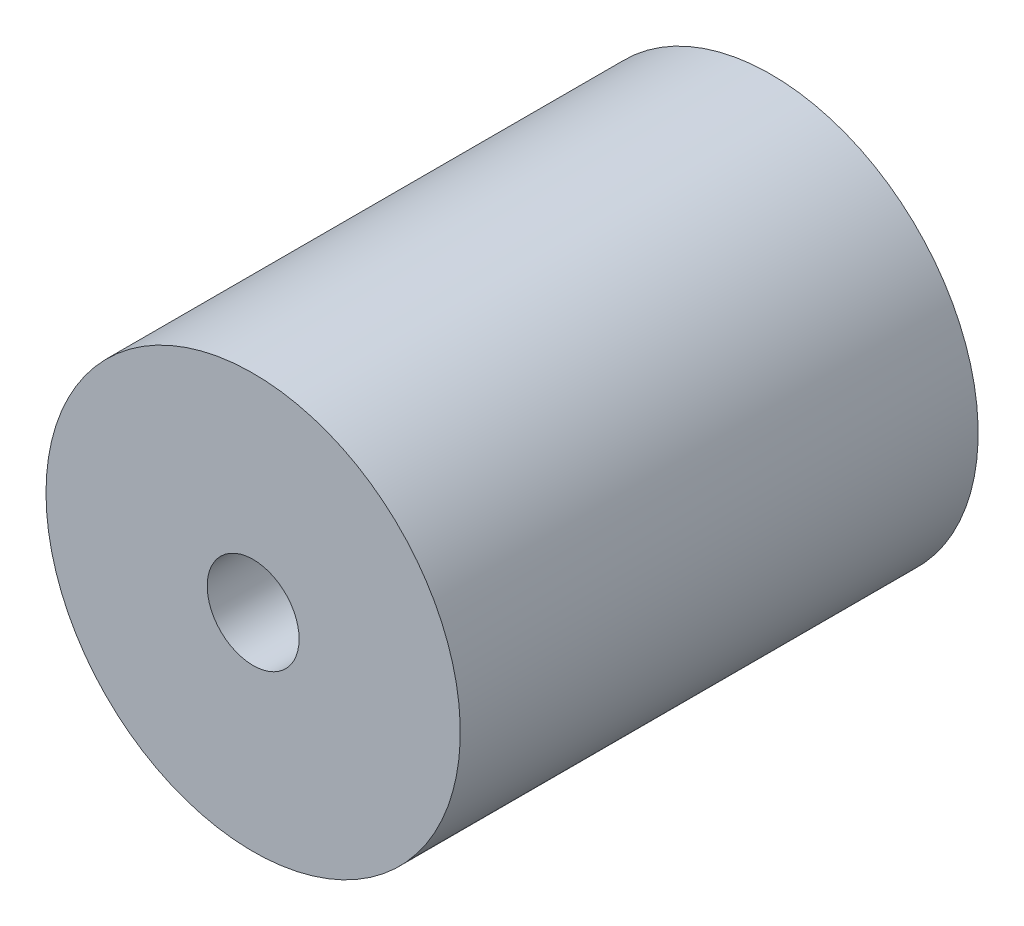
ISO-10303-21;
HEADER;
FILE_DESCRIPTION(('STEP AP214'),'2;1');
FILE_NAME('part.step','',(''),(''),'','','');
FILE_SCHEMA(('AUTOMOTIVE_DESIGN { 1 0 10303 214 1 1 1 1 }'));
ENDSEC;
DATA;
#1=APPLICATION_CONTEXT('core data for automotive mechanical design processes');
#2=APPLICATION_PROTOCOL_DEFINITION('international standard','automotive_design',2000,#1);
#3=PRODUCT_CONTEXT('',#1,'mechanical');
#4=PRODUCT('Part','Part','',(#3));
#5=PRODUCT_RELATED_PRODUCT_CATEGORY('part','',(#4));
#6=PRODUCT_DEFINITION_FORMATION('','',#4);
#7=PRODUCT_DEFINITION_CONTEXT('part definition',#1,'design');
#8=PRODUCT_DEFINITION('design','',#6,#7);
#9=PRODUCT_DEFINITION_SHAPE('','',#8);
#10=(LENGTH_UNIT() NAMED_UNIT(*) SI_UNIT(.MILLI.,.METRE.));
#11=(NAMED_UNIT(*) PLANE_ANGLE_UNIT() SI_UNIT($,.RADIAN.));
#12=(NAMED_UNIT(*) SI_UNIT($,.STERADIAN.) SOLID_ANGLE_UNIT());
#13=UNCERTAINTY_MEASURE_WITH_UNIT(LENGTH_MEASURE(1.E-05),#10,'distance_accuracy_value','');
#14=(GEOMETRIC_REPRESENTATION_CONTEXT(3) GLOBAL_UNCERTAINTY_ASSIGNED_CONTEXT((#13)) GLOBAL_UNIT_ASSIGNED_CONTEXT((#10,
#11,#12)) REPRESENTATION_CONTEXT('',''));
#15=CARTESIAN_POINT('',(0.,0.,0.));
#16=DIRECTION('',(0.,0.,1.));
#17=DIRECTION('',(1.,0.,0.));
#18=AXIS2_PLACEMENT_3D('',#15,#16,#17);
#19=CARTESIAN_POINT('',(0.,0.,15.24));
#20=DIRECTION('',(0.,0.,-1.));
#21=DIRECTION('',(-1.,0.,0.));
#22=AXIS2_PLACEMENT_3D('',#19,#20,#21);
#23=CYLINDRICAL_SURFACE('',#22,6.096);
#24=CARTESIAN_POINT('',(0.,0.,15.24));
#25=DIRECTION('',(0.,0.,1.));
#26=DIRECTION('',(1.,0.,0.));
#27=AXIS2_PLACEMENT_3D('',#24,#25,#26);
#28=CIRCLE('',#27,6.096);
#29=CARTESIAN_POINT('',(-6.096,0.,15.24));
#30=VERTEX_POINT('',#29);
#31=EDGE_CURVE('E12',#30,#30,#28,.T.);
#32=CARTESIAN_POINT('',(0.,0.,0.));
#33=DIRECTION('',(0.,0.,1.));
#34=DIRECTION('',(1.,0.,0.));
#35=AXIS2_PLACEMENT_3D('',#32,#33,#34);
#36=CIRCLE('',#35,6.096);
#37=CARTESIAN_POINT('',(-6.096,0.,0.));
#38=VERTEX_POINT('',#37);
#39=EDGE_CURVE('E56',#38,#38,#36,.T.);
#40=CARTESIAN_POINT('',(-6.096,0.,15.24));
#41=CARTESIAN_POINT('',(-6.096,0.,15.08125));
#42=CARTESIAN_POINT('',(-6.096,0.,14.9225));
#43=CARTESIAN_POINT('',(-6.096,0.,14.605));
#44=CARTESIAN_POINT('',(-6.096,0.,14.44625));
#45=CARTESIAN_POINT('',(-6.096,0.,14.12875));
#46=CARTESIAN_POINT('',(-6.096,0.,13.97));
#47=CARTESIAN_POINT('',(-6.096,0.,13.6525));
#48=CARTESIAN_POINT('',(-6.096,0.,13.49375));
#49=CARTESIAN_POINT('',(-6.096,0.,13.17625));
#50=CARTESIAN_POINT('',(-6.096,0.,13.0175));
#51=CARTESIAN_POINT('',(-6.096,0.,12.7));
#52=CARTESIAN_POINT('',(-6.096,0.,12.54125));
#53=CARTESIAN_POINT('',(-6.096,0.,12.22375));
#54=CARTESIAN_POINT('',(-6.096,0.,12.065));
#55=CARTESIAN_POINT('',(-6.096,0.,11.7475));
#56=CARTESIAN_POINT('',(-6.096,0.,11.58875));
#57=CARTESIAN_POINT('',(-6.096,0.,11.27125));
#58=CARTESIAN_POINT('',(-6.096,0.,11.1125));
#59=CARTESIAN_POINT('',(-6.096,0.,10.795));
#60=CARTESIAN_POINT('',(-6.096,0.,10.63625));
#61=CARTESIAN_POINT('',(-6.096,0.,10.31875));
#62=CARTESIAN_POINT('',(-6.096,0.,10.16));
#63=CARTESIAN_POINT('',(-6.096,0.,9.8425));
#64=CARTESIAN_POINT('',(-6.096,0.,9.68375));
#65=CARTESIAN_POINT('',(-6.096,0.,9.36625));
#66=CARTESIAN_POINT('',(-6.096,0.,9.2075));
#67=CARTESIAN_POINT('',(-6.096,0.,8.89));
#68=CARTESIAN_POINT('',(-6.096,0.,8.73125));
#69=CARTESIAN_POINT('',(-6.096,0.,8.41375));
#70=CARTESIAN_POINT('',(-6.096,0.,8.255));
#71=CARTESIAN_POINT('',(-6.096,0.,7.9375));
#72=CARTESIAN_POINT('',(-6.096,0.,7.77875));
#73=CARTESIAN_POINT('',(-6.096,0.,7.46125));
#74=CARTESIAN_POINT('',(-6.096,0.,7.3025));
#75=CARTESIAN_POINT('',(-6.096,0.,6.985));
#76=CARTESIAN_POINT('',(-6.096,0.,6.82625));
#77=CARTESIAN_POINT('',(-6.096,0.,6.50875));
#78=CARTESIAN_POINT('',(-6.096,0.,6.35));
#79=CARTESIAN_POINT('',(-6.096,0.,6.0325));
#80=CARTESIAN_POINT('',(-6.096,0.,5.87375));
#81=CARTESIAN_POINT('',(-6.096,0.,5.55625));
#82=CARTESIAN_POINT('',(-6.096,0.,5.3975));
#83=CARTESIAN_POINT('',(-6.096,0.,5.08));
#84=CARTESIAN_POINT('',(-6.096,0.,4.92125));
#85=CARTESIAN_POINT('',(-6.096,0.,4.60375));
#86=CARTESIAN_POINT('',(-6.096,0.,4.445));
#87=CARTESIAN_POINT('',(-6.096,0.,4.1275));
#88=CARTESIAN_POINT('',(-6.096,0.,3.96875));
#89=CARTESIAN_POINT('',(-6.096,0.,3.65125));
#90=CARTESIAN_POINT('',(-6.096,0.,3.4925));
#91=CARTESIAN_POINT('',(-6.096,0.,3.175));
#92=CARTESIAN_POINT('',(-6.096,0.,3.01625));
#93=CARTESIAN_POINT('',(-6.096,0.,2.69875));
#94=CARTESIAN_POINT('',(-6.096,0.,2.54));
#95=CARTESIAN_POINT('',(-6.096,0.,2.2225));
#96=CARTESIAN_POINT('',(-6.096,0.,2.06375));
#97=CARTESIAN_POINT('',(-6.096,0.,1.74625));
#98=CARTESIAN_POINT('',(-6.096,0.,1.5875));
#99=CARTESIAN_POINT('',(-6.096,0.,1.27));
#100=CARTESIAN_POINT('',(-6.096,0.,1.11125));
#101=CARTESIAN_POINT('',(-6.096,0.,0.79375));
#102=CARTESIAN_POINT('',(-6.096,0.,0.634999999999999));
#103=CARTESIAN_POINT('',(-6.096,0.,0.3175));
#104=CARTESIAN_POINT('',(-6.096,0.,0.15875));
#105=CARTESIAN_POINT('',(-6.096,0.,0.));
#106=B_SPLINE_CURVE_WITH_KNOTS('',3,(#40,#41,#42,#43,#44,#45,#46,#47,#48,#49,#50,#51,#52,#53,
#54,#55,#56,#57,#58,#59,#60,#61,#62,#63,#64,#65,#66,#67,#68,#69,#70,#71,#72,#73,#74,#75,#76,#77,
#78,#79,#80,#81,#82,#83,#84,#85,#86,#87,#88,#89,#90,#91,#92,#93,#94,#95,#96,#97,#98,#99,#100,
#101,#102,#103,#104,#105),.UNSPECIFIED.,.F.,.F.,(4,2,2,2,2,2,2,2,2,2,2,2,2,2,2,2,2,2,2,2,2,2,2,
2,2,2,2,2,2,2,2,2,4),(0.,0.476250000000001,0.9525,1.42875,1.905,2.38125,2.8575,3.33375,3.81,
4.28625,4.7625,5.23875,5.715,6.19125,6.6675,7.14375,7.62,8.09625,8.5725,9.04875,9.525,10.00125,
10.4775,10.95375,11.43,11.90625,12.3825,12.85875,13.335,13.81125,14.2875,14.76375,15.24),.UNSPECIFIED.);
#107=EDGE_CURVE('BSEAM45',#30,#38,#106,.T.);
#108=ORIENTED_EDGE('',*,*,#31,.F.);
#109=ORIENTED_EDGE('',*,*,#39,.T.);
#110=ORIENTED_EDGE('',*,*,#107,.T.);
#111=ORIENTED_EDGE('',*,*,#107,.F.);
#112=EDGE_LOOP('',(#108,#110,#109,#111));
#113=FACE_BOUND('',#112,.T.);
#114=ADVANCED_FACE('F45',(#113),#23,.T.);
#115=CARTESIAN_POINT('',(0.,0.,15.24));
#116=DIRECTION('',(0.,0.,1.));
#117=DIRECTION('',(1.,0.,0.));
#118=AXIS2_PLACEMENT_3D('',#115,#116,#117);
#119=PLANE('',#118);
#120=CARTESIAN_POINT('',(0.,0.,15.24));
#121=DIRECTION('',(0.,0.,1.));
#122=DIRECTION('',(1.,0.,0.));
#123=AXIS2_PLACEMENT_3D('',#120,#121,#122);
#124=CIRCLE('',#123,1.35254999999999);
#125=CARTESIAN_POINT('',(1.35254999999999,0.,15.24));
#126=VERTEX_POINT('',#125);
#127=EDGE_CURVE('E65',#126,#126,#124,.T.);
#128=ORIENTED_EDGE('',*,*,#127,.F.);
#129=EDGE_LOOP('',(#128));
#130=FACE_BOUND('',#129,.T.);
#131=ORIENTED_EDGE('',*,*,#31,.T.);
#132=EDGE_LOOP('',(#131));
#133=FACE_BOUND('',#132,.T.);
#134=ADVANCED_FACE('F81',(#130,#133),#119,.T.);
#135=CARTESIAN_POINT('',(0.,0.,0.));
#136=DIRECTION('',(0.,0.,1.));
#137=DIRECTION('',(1.,0.,0.));
#138=AXIS2_PLACEMENT_3D('',#135,#136,#137);
#139=PLANE('',#138);
#140=CARTESIAN_POINT('',(-1.31643891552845E-05,-2.1722312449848E-05,0.));
#141=DIRECTION('',(0.,0.,-1.));
#142=DIRECTION('',(-1.,0.,0.));
#143=AXIS2_PLACEMENT_3D('',#140,#141,#142);
#144=CIRCLE('',#143,2.0193);
#145=CARTESIAN_POINT('',(-2.01931316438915,-2.1722312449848E-05,0.));
#146=VERTEX_POINT('',#145);
#147=EDGE_CURVE('E71',#146,#146,#144,.T.);
#148=ORIENTED_EDGE('',*,*,#147,.F.);
#149=EDGE_LOOP('',(#148));
#150=FACE_BOUND('',#149,.T.);
#151=ORIENTED_EDGE('',*,*,#39,.F.);
#152=EDGE_LOOP('',(#151));
#153=FACE_BOUND('',#152,.T.);
#154=ADVANCED_FACE('F77',(#150,#153),#139,.F.);
#155=CARTESIAN_POINT('',(0.,0.,8.89));
#156=DIRECTION('',(0.,0.,1.));
#157=DIRECTION('',(1.,0.,0.));
#158=AXIS2_PLACEMENT_3D('',#155,#156,#157);
#159=CONICAL_SURFACE('',#158,1.35255,1.02974425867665);
#160=CARTESIAN_POINT('',(0.32604917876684,0.538007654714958,8.45530427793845));
#161=CARTESIAN_POINT('',(0.356269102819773,0.519691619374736,8.45530427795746));
#162=CARTESIAN_POINT('',(0.384964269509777,0.498810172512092,8.45530431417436));
#163=CARTESIAN_POINT('',(0.438464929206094,0.452508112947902,8.45530445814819));
#164=CARTESIAN_POINT('',(0.463265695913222,0.427082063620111,8.45530456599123));
#165=CARTESIAN_POINT('',(0.508235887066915,0.372436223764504,8.4553048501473));
#166=CARTESIAN_POINT('',(0.528407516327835,0.343218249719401,8.45530502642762));
#167=CARTESIAN_POINT('',(0.563553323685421,0.281818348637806,8.45530544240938));
#168=CARTESIAN_POINT('',(0.578528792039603,0.249637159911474,8.45530568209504));
#169=CARTESIAN_POINT('',(0.602866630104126,0.183213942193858,8.4553062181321));
#170=CARTESIAN_POINT('',(0.612228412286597,0.148971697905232,8.45530651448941));
#171=CARTESIAN_POINT('',(0.625070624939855,0.0794002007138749,8.45530715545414));
#172=CARTESIAN_POINT('',(0.628550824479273,0.0440709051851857,8.45530750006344));
#173=CARTESIAN_POINT('',(0.629530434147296,-0.0266698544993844,8.45530822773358));
#174=CARTESIAN_POINT('',(0.627029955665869,-0.0620813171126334,8.4553086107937));
#175=CARTESIAN_POINT('',(0.616119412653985,-0.131981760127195,8.4553094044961));
#176=CARTESIAN_POINT('',(0.607709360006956,-0.166470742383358,8.45530981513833));
#177=CARTESIAN_POINT('',(0.585218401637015,-0.233547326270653,8.45531065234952));
#178=CARTESIAN_POINT('',(0.571137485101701,-0.26613492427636,8.45531107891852));
#179=CARTESIAN_POINT('',(0.537704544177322,-0.328483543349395,8.45531193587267));
#180=CARTESIAN_POINT('',(0.51835252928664,-0.358244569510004,8.45531236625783));
#181=CARTESIAN_POINT('',(0.474926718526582,-0.414095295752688,8.45531321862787));
#182=CARTESIAN_POINT('',(0.450852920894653,-0.440184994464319,8.45531364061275));
#183=CARTESIAN_POINT('',(0.398666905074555,-0.48795246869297,8.45531446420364));
#184=CARTESIAN_POINT('',(0.370554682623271,-0.509630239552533,8.45531486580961));
#185=CARTESIAN_POINT('',(0.311089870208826,-0.547958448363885,8.45531563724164));
#186=CARTESIAN_POINT('',(0.279737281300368,-0.564608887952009,8.45531600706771));
#187=CARTESIAN_POINT('',(0.214681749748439,-0.592409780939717,8.45531670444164));
#188=CARTESIAN_POINT('',(0.180978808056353,-0.603560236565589,8.45531703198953));
#189=CARTESIAN_POINT('',(0.11217928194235,-0.620044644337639,8.45531763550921));
#190=CARTESIAN_POINT('',(0.0770826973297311,-0.625378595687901,8.455317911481));
#191=CARTESIAN_POINT('',(0.00649217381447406,-0.630078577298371,8.45531840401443));
#192=CARTESIAN_POINT('',(-0.0290017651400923,-0.629444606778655,8.45531862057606));
#193=CARTESIAN_POINT('',(-0.0993794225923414,-0.622226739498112,8.45531898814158));
#194=CARTESIAN_POINT('',(-0.134263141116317,-0.615642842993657,8.45531913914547));
#195=CARTESIAN_POINT('',(-0.202430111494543,-0.596712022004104,8.45531937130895));
#196=CARTESIAN_POINT('',(-0.2357133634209,-0.584365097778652,8.45531945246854));
#197=CARTESIAN_POINT('',(-0.29973458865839,-0.554258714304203,8.45531954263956));
#198=CARTESIAN_POINT('',(-0.330472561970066,-0.536499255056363,8.45531955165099));
#199=CARTESIAN_POINT('',(-0.388530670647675,-0.496071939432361,8.45531949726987));
#200=CARTESIAN_POINT('',(-0.415850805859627,-0.473404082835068,8.45531943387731));
#201=CARTESIAN_POINT('',(-0.466297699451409,-0.423803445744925,8.45531923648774));
#202=CARTESIAN_POINT('',(-0.489424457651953,-0.396870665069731,8.45531910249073));
#203=CARTESIAN_POINT('',(-0.530828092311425,-0.339504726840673,8.45531876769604));
#204=CARTESIAN_POINT('',(-0.54910496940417,-0.309071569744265,8.45531856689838));
#205=CARTESIAN_POINT('',(-0.580290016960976,-0.245568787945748,8.45531810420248));
#206=CARTESIAN_POINT('',(-0.593198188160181,-0.212499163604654,8.45531784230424));
#207=CARTESIAN_POINT('',(-0.613279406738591,-0.144662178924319,8.4553172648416));
#208=CARTESIAN_POINT('',(-0.620452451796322,-0.109894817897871,8.45531694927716));
#209=CARTESIAN_POINT('',(-0.628859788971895,-0.0396493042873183,8.45531627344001));
#210=CARTESIAN_POINT('',(-0.63009407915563,-0.00417115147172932,8.45531591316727));
#211=CARTESIAN_POINT('',(-0.626588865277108,0.0664887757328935,8.45531515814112));
#212=CARTESIAN_POINT('',(-0.621849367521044,0.101670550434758,8.45531476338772));
#213=CARTESIAN_POINT('',(-0.60653113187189,0.170739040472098,8.45531395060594));
#214=CARTESIAN_POINT('',(-0.595952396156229,0.204625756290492,8.45531353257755));
#215=CARTESIAN_POINT('',(-0.569255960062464,0.270142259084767,8.45531268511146));
#216=CARTESIAN_POINT('',(-0.553138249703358,0.301772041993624,8.45531225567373));
#217=CARTESIAN_POINT('',(-0.515821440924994,0.361876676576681,8.455311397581));
#218=CARTESIAN_POINT('',(-0.494622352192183,0.39035153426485,8.45531096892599));
#219=CARTESIAN_POINT('',(-0.447744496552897,0.443338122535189,8.45531012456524));
#220=CARTESIAN_POINT('',(-0.422065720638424,0.467849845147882,8.45530970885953));
#221=CARTESIAN_POINT('',(-0.36695697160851,0.512214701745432,8.45530890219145));
#222=CARTESIAN_POINT('',(-0.337526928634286,0.53206774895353,8.45530851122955));
#223=CARTESIAN_POINT('',(-0.27575261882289,0.566550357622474,8.45530776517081));
#224=CARTESIAN_POINT('',(-0.243408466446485,0.581180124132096,8.45530741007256));
#225=CARTESIAN_POINT('',(-0.176726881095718,0.604800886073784,8.45530674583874));
#226=CARTESIAN_POINT('',(-0.142389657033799,0.613792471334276,8.45530643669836));
#227=CARTESIAN_POINT('',(-0.0726835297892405,0.625885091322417,8.45530587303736));
#228=CARTESIAN_POINT('',(-0.0373143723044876,0.628984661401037,8.45530561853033));
#229=CARTESIAN_POINT('',(0.0334559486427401,0.629202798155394,8.45530517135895));
#230=CARTESIAN_POINT('',(0.0688571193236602,0.626318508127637,8.45530497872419));
#231=CARTESIAN_POINT('',(0.138641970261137,0.614644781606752,8.45530466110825));
#232=CARTESIAN_POINT('',(0.173026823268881,0.605862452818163,8.45530453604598));
#233=CARTESIAN_POINT('',(0.227268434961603,0.587025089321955,8.45530439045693));
#234=CARTESIAN_POINT('',(0.247736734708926,0.578683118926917,8.45530434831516));
#235=CARTESIAN_POINT('',(0.287684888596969,0.559897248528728,8.45530429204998));
#236=CARTESIAN_POINT('',(0.307164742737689,0.549453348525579,8.45530427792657));
#237=CARTESIAN_POINT('',(0.32604917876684,0.538007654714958,8.45530427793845));
#238=B_SPLINE_CURVE_WITH_KNOTS('',3,(#160,#161,#162,#163,#164,#165,#166,#167,#168,#169,#170,
#171,#172,#173,#174,#175,#176,#177,#178,#179,#180,#181,#182,#183,#184,#185,#186,#187,#188,#189,
#190,#191,#192,#193,#194,#195,#196,#197,#198,#199,#200,#201,#202,#203,#204,#205,#206,#207,#208,
#209,#210,#211,#212,#213,#214,#215,#216,#217,#218,#219,#220,#221,#222,#223,#224,#225,#226,#227,
#228,#229,#230,#231,#232,#233,#234,#235,#236,#237),.UNSPECIFIED.,.T.,.F.,(4,2,2,2,2,2,2,2,2,2,2,
2,2,2,2,2,2,2,2,2,2,2,2,2,2,2,2,2,2,2,2,2,2,2,2,2,2,2,4),(0.,0.105931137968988,
0.211989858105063,0.317997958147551,0.423979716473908,0.529972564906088,0.635969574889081,
0.741964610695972,0.847959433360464,0.953954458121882,1.05994929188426,1.1659441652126,
1.27193915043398,1.37793410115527,1.48392900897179,1.58992393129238,1.69591886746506,
1.80191379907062,1.9079087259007,2.01390365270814,2.11989858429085,2.22589352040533,
2.33188844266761,2.43788335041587,2.54387830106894,2.64987328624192,2.75586815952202,
2.86186299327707,2.96785801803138,3.07385284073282,3.17984787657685,3.28584488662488,
3.39183773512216,3.49781949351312,3.60382759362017,3.7098863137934,3.81581745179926,
3.88201383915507,3.94821022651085),.UNSPECIFIED.);
#239=CARTESIAN_POINT('',(0.32604917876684,0.538007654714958,8.45530427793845));
#240=VERTEX_POINT('',#239);
#241=EDGE_CURVE('E48',#240,#240,#238,.T.);
#242=ORIENTED_EDGE('',*,*,#241,.T.);
#243=EDGE_LOOP('',(#242));
#244=FACE_BOUND('',#243,.T.);
#245=CARTESIAN_POINT('',(0.,0.,8.89));
#246=DIRECTION('',(0.,0.,1.));
#247=DIRECTION('',(1.,0.,0.));
#248=AXIS2_PLACEMENT_3D('',#245,#246,#247);
#249=CIRCLE('',#248,1.35255);
#250=CARTESIAN_POINT('',(1.35255,0.,8.89));
#251=VERTEX_POINT('',#250);
#252=EDGE_CURVE('E61',#251,#251,#249,.T.);
#253=ORIENTED_EDGE('',*,*,#252,.T.);
#254=EDGE_LOOP('',(#253));
#255=FACE_BOUND('',#254,.T.);
#256=ADVANCED_FACE('F80',(#244,#255),#159,.F.);
#257=CARTESIAN_POINT('',(0.,0.,15.24));
#258=DIRECTION('',(0.,0.,1.));
#259=DIRECTION('',(1.,0.,0.));
#260=AXIS2_PLACEMENT_3D('',#257,#258,#259);
#261=CYLINDRICAL_SURFACE('',#260,1.35254999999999);
#262=ORIENTED_EDGE('',*,*,#252,.F.);
#263=EDGE_LOOP('',(#262));
#264=FACE_BOUND('',#263,.T.);
#265=ORIENTED_EDGE('',*,*,#127,.T.);
#266=EDGE_LOOP('',(#265));
#267=FACE_BOUND('',#266,.T.);
#268=ADVANCED_FACE('F97',(#264,#267),#261,.F.);
#269=CARTESIAN_POINT('',(-1.31643891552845E-05,-2.1722312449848E-05,7.62));
#270=DIRECTION('',(0.,0.,-1.));
#271=DIRECTION('',(-1.,0.,0.));
#272=AXIS2_PLACEMENT_3D('',#269,#270,#271);
#273=CONICAL_SURFACE('',#272,2.0193,1.02974425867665);
#274=CARTESIAN_POINT('',(-1.31643891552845E-05,-2.1722312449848E-05,7.62));
#275=DIRECTION('',(0.,0.,-1.));
#276=DIRECTION('',(-1.,0.,0.));
#277=AXIS2_PLACEMENT_3D('',#274,#275,#276);
#278=CIRCLE('',#277,2.0193);
#279=CARTESIAN_POINT('',(-2.01931316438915,-2.1722312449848E-05,7.62));
#280=VERTEX_POINT('',#279);
#281=EDGE_CURVE('E68',#280,#280,#278,.T.);
#282=ORIENTED_EDGE('',*,*,#281,.T.);
#283=EDGE_LOOP('',(#282));
#284=FACE_BOUND('',#283,.T.);
#285=ORIENTED_EDGE('',*,*,#241,.F.);
#286=EDGE_LOOP('',(#285));
#287=FACE_BOUND('',#286,.T.);
#288=ADVANCED_FACE('F100',(#284,#287),#273,.F.);
#289=CARTESIAN_POINT('',(-1.31643891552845E-05,-2.1722312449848E-05,0.));
#290=DIRECTION('',(0.,0.,-1.));
#291=DIRECTION('',(-1.,0.,0.));
#292=AXIS2_PLACEMENT_3D('',#289,#290,#291);
#293=CYLINDRICAL_SURFACE('',#292,2.0193);
#294=ORIENTED_EDGE('',*,*,#281,.F.);
#295=EDGE_LOOP('',(#294));
#296=FACE_BOUND('',#295,.T.);
#297=ORIENTED_EDGE('',*,*,#147,.T.);
#298=EDGE_LOOP('',(#297));
#299=FACE_BOUND('',#298,.T.);
#300=ADVANCED_FACE('F75',(#296,#299),#293,.F.);
#301=CLOSED_SHELL('',(#114,#134,#154,#256,#268,#288,#300));
#302=MANIFOLD_SOLID_BREP('B2',#301);
#303=ADVANCED_BREP_SHAPE_REPRESENTATION('',(#18,#302),#14);
#304=SHAPE_DEFINITION_REPRESENTATION(#9,#303);
ENDSEC;
END-ISO-10303-21;
